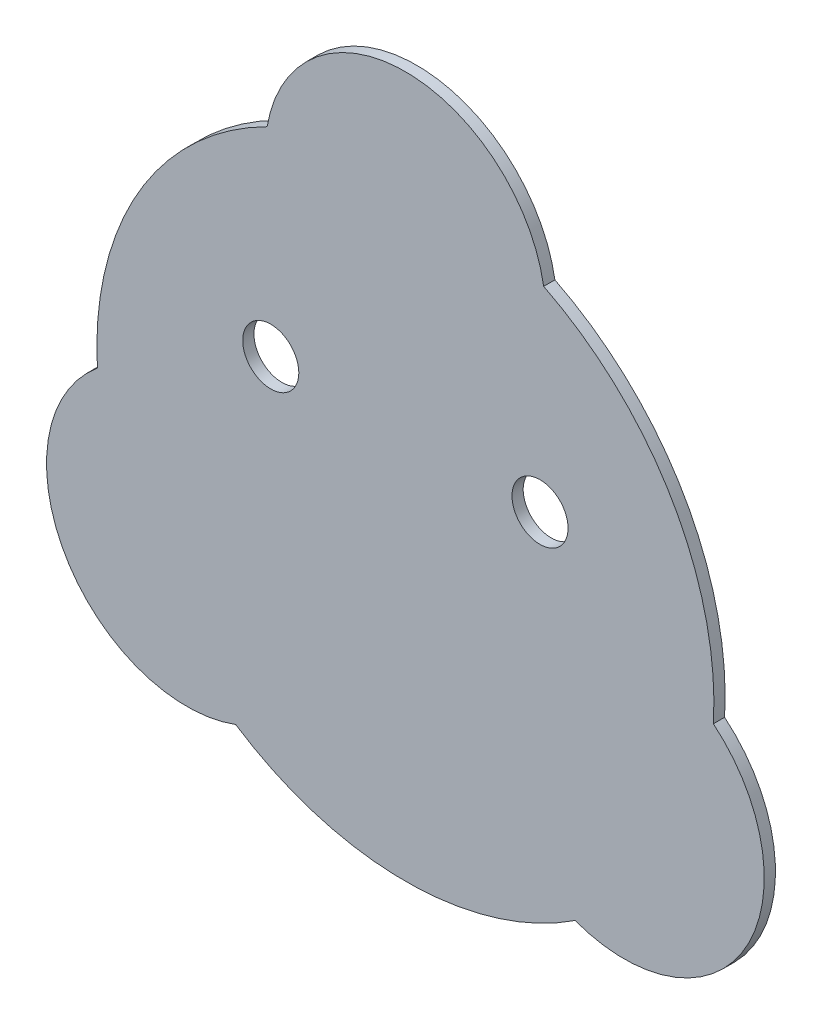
ISO-10303-21;
HEADER;
FILE_DESCRIPTION(('STEP AP214'),'2;1');
FILE_NAME('part.step','',(''),(''),'','','');
FILE_SCHEMA(('AUTOMOTIVE_DESIGN { 1 0 10303 214 1 1 1 1 }'));
ENDSEC;
DATA;
#1=APPLICATION_CONTEXT('core data for automotive mechanical design processes');
#2=APPLICATION_PROTOCOL_DEFINITION('international standard','automotive_design',2000,#1);
#3=PRODUCT_CONTEXT('',#1,'mechanical');
#4=PRODUCT('Part','Part','',(#3));
#5=PRODUCT_RELATED_PRODUCT_CATEGORY('part','',(#4));
#6=PRODUCT_DEFINITION_FORMATION('','',#4);
#7=PRODUCT_DEFINITION_CONTEXT('part definition',#1,'design');
#8=PRODUCT_DEFINITION('design','',#6,#7);
#9=PRODUCT_DEFINITION_SHAPE('','',#8);
#10=(LENGTH_UNIT() NAMED_UNIT(*) SI_UNIT(.MILLI.,.METRE.));
#11=(NAMED_UNIT(*) PLANE_ANGLE_UNIT() SI_UNIT($,.RADIAN.));
#12=(NAMED_UNIT(*) SI_UNIT($,.STERADIAN.) SOLID_ANGLE_UNIT());
#13=UNCERTAINTY_MEASURE_WITH_UNIT(LENGTH_MEASURE(1.E-05),#10,'distance_accuracy_value','');
#14=(GEOMETRIC_REPRESENTATION_CONTEXT(3) GLOBAL_UNCERTAINTY_ASSIGNED_CONTEXT((#13)) GLOBAL_UNIT_ASSIGNED_CONTEXT((#10,
#11,#12)) REPRESENTATION_CONTEXT('',''));
#15=CARTESIAN_POINT('',(0.,0.,0.));
#16=DIRECTION('',(0.,0.,1.));
#17=DIRECTION('',(1.,0.,0.));
#18=AXIS2_PLACEMENT_3D('',#15,#16,#17);
#19=CARTESIAN_POINT('',(-443.859368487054,1317.25514614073,-2000.));
#20=DIRECTION('',(0.,0.,1.));
#21=DIRECTION('',(1.,0.,0.));
#22=AXIS2_PLACEMENT_3D('',#19,#20,#21);
#23=PLANE('',#22);
#24=CARTESIAN_POINT('',(-422.11658269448,1329.88014614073,-2000.));
#25=DIRECTION('',(0.,0.,1.));
#26=DIRECTION('',(1.,0.,0.));
#27=AXIS2_PLACEMENT_3D('',#24,#25,#26);
#28=CIRCLE('',#27,2.49999999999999);
#29=CARTESIAN_POINT('',(-419.61658269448,1329.88014614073,-2000.));
#30=VERTEX_POINT('',#29);
#31=EDGE_CURVE('E126',#30,#30,#28,.T.);
#32=ORIENTED_EDGE('',*,*,#31,.F.);
#33=EDGE_LOOP('',(#32));
#34=FACE_BOUND('',#33,.T.);
#35=CARTESIAN_POINT('',(-453.602154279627,1311.63014614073,-2000.));
#36=DIRECTION('',(0.,0.,1.));
#37=DIRECTION('',(1.,0.,0.));
#38=AXIS2_PLACEMENT_3D('',#35,#36,#37);
#39=CIRCLE('',#38,12.5);
#40=CARTESIAN_POINT('',(-461.568956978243,1321.26238652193,-2000.));
#41=VERTEX_POINT('',#40);
#42=CARTESIAN_POINT('',(-449.24379076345,1299.91457242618,-2000.));
#43=VERTEX_POINT('',#42);
#44=EDGE_CURVE('E133',#41,#43,#39,.T.);
#45=ORIENTED_EDGE('',*,*,#44,.T.);
#46=CARTESIAN_POINT('',(-434.11658269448,1322.88014614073,-2000.));
#47=DIRECTION('',(0.,0.,1.));
#48=DIRECTION('',(1.,0.,0.));
#49=AXIS2_PLACEMENT_3D('',#46,#47,#48);
#50=CIRCLE('',#49,27.5);
#51=CARTESIAN_POINT('',(-418.989374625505,1299.91457242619,-2000.));
#52=VERTEX_POINT('',#51);
#53=EDGE_CURVE('E91',#43,#52,#50,.T.);
#54=ORIENTED_EDGE('',*,*,#53,.T.);
#55=CARTESIAN_POINT('',(-414.631011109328,1311.63014614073,-2000.));
#56=DIRECTION('',(0.,0.,1.));
#57=DIRECTION('',(1.,0.,0.));
#58=AXIS2_PLACEMENT_3D('',#55,#56,#57);
#59=CIRCLE('',#58,12.5);
#60=CARTESIAN_POINT('',(-406.664208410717,1321.26238652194,-2000.));
#61=VERTEX_POINT('',#60);
#62=EDGE_CURVE('E104',#52,#61,#59,.T.);
#63=ORIENTED_EDGE('',*,*,#62,.T.);
#64=CARTESIAN_POINT('',(-434.11658269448,1322.88014614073,-2000.));
#65=DIRECTION('',(0.,0.,1.));
#66=DIRECTION('',(1.,0.,0.));
#67=AXIS2_PLACEMENT_3D('',#64,#65,#66);
#68=CIRCLE('',#67,27.5);
#69=CARTESIAN_POINT('',(-421.791416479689,1347.46347947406,-2000.));
#70=VERTEX_POINT('',#69);
#71=EDGE_CURVE('E98',#61,#70,#68,.T.);
#72=ORIENTED_EDGE('',*,*,#71,.T.);
#73=CARTESIAN_POINT('',(-434.11658269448,1345.38014614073,-2000.));
#74=DIRECTION('',(0.,0.,1.));
#75=DIRECTION('',(1.,0.,0.));
#76=AXIS2_PLACEMENT_3D('',#73,#74,#75);
#77=CIRCLE('',#76,12.5000000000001);
#78=CARTESIAN_POINT('',(-446.441748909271,1347.46347947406,-2000.));
#79=VERTEX_POINT('',#78);
#80=EDGE_CURVE('E102',#70,#79,#77,.T.);
#81=ORIENTED_EDGE('',*,*,#80,.T.);
#82=CARTESIAN_POINT('',(-434.11658269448,1322.88014614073,-2000.));
#83=DIRECTION('',(0.,0.,1.));
#84=DIRECTION('',(1.,0.,0.));
#85=AXIS2_PLACEMENT_3D('',#82,#83,#84);
#86=CIRCLE('',#85,27.5000000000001);
#87=EDGE_CURVE('E54',#79,#41,#86,.T.);
#88=ORIENTED_EDGE('',*,*,#87,.T.);
#89=EDGE_LOOP('',(#45,#54,#63,#72,#81,#88));
#90=FACE_BOUND('',#89,.T.);
#91=CARTESIAN_POINT('',(-446.11658269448,1329.88014614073,-2000.));
#92=DIRECTION('',(0.,0.,1.));
#93=DIRECTION('',(1.,0.,0.));
#94=AXIS2_PLACEMENT_3D('',#91,#92,#93);
#95=CIRCLE('',#94,2.49999999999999);
#96=CARTESIAN_POINT('',(-443.61658269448,1329.88014614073,-2000.));
#97=VERTEX_POINT('',#96);
#98=EDGE_CURVE('E175',#97,#97,#95,.T.);
#99=ORIENTED_EDGE('',*,*,#98,.F.);
#100=EDGE_LOOP('',(#99));
#101=FACE_BOUND('',#100,.T.);
#102=ADVANCED_FACE('F37',(#34,#90,#101),#23,.T.);
#103=CARTESIAN_POINT('',(-443.859368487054,1317.25514614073,-2001.));
#104=DIRECTION('',(0.,0.,1.));
#105=DIRECTION('',(1.,0.,0.));
#106=AXIS2_PLACEMENT_3D('',#103,#104,#105);
#107=PLANE('',#106);
#108=CARTESIAN_POINT('',(-453.602154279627,1311.63014614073,-2001.));
#109=DIRECTION('',(0.,0.,1.));
#110=DIRECTION('',(1.,0.,0.));
#111=AXIS2_PLACEMENT_3D('',#108,#109,#110);
#112=CIRCLE('',#111,12.5);
#113=CARTESIAN_POINT('',(-461.568956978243,1321.26238652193,-2001.));
#114=VERTEX_POINT('',#113);
#115=CARTESIAN_POINT('',(-449.24379076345,1299.91457242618,-2001.));
#116=VERTEX_POINT('',#115);
#117=EDGE_CURVE('E122',#114,#116,#112,.T.);
#118=ORIENTED_EDGE('',*,*,#117,.F.);
#119=CARTESIAN_POINT('',(-434.11658269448,1322.88014614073,-2001.));
#120=DIRECTION('',(0.,0.,1.));
#121=DIRECTION('',(1.,0.,0.));
#122=AXIS2_PLACEMENT_3D('',#119,#120,#121);
#123=CIRCLE('',#122,27.5000000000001);
#124=CARTESIAN_POINT('',(-446.441748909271,1347.46347947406,-2001.));
#125=VERTEX_POINT('',#124);
#126=EDGE_CURVE('E83',#125,#114,#123,.T.);
#127=ORIENTED_EDGE('',*,*,#126,.F.);
#128=CARTESIAN_POINT('',(-434.11658269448,1345.38014614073,-2001.));
#129=DIRECTION('',(0.,0.,1.));
#130=DIRECTION('',(1.,0.,0.));
#131=AXIS2_PLACEMENT_3D('',#128,#129,#130);
#132=CIRCLE('',#131,12.5000000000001);
#133=CARTESIAN_POINT('',(-421.791416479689,1347.46347947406,-2001.));
#134=VERTEX_POINT('',#133);
#135=EDGE_CURVE('E77',#134,#125,#132,.T.);
#136=ORIENTED_EDGE('',*,*,#135,.F.);
#137=CARTESIAN_POINT('',(-434.11658269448,1322.88014614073,-2001.));
#138=DIRECTION('',(0.,0.,1.));
#139=DIRECTION('',(1.,0.,0.));
#140=AXIS2_PLACEMENT_3D('',#137,#138,#139);
#141=CIRCLE('',#140,27.5);
#142=CARTESIAN_POINT('',(-406.664208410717,1321.26238652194,-2001.));
#143=VERTEX_POINT('',#142);
#144=EDGE_CURVE('E112',#143,#134,#141,.T.);
#145=ORIENTED_EDGE('',*,*,#144,.F.);
#146=CARTESIAN_POINT('',(-414.631011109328,1311.63014614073,-2001.));
#147=DIRECTION('',(0.,0.,1.));
#148=DIRECTION('',(1.,0.,0.));
#149=AXIS2_PLACEMENT_3D('',#146,#147,#148);
#150=CIRCLE('',#149,12.5);
#151=CARTESIAN_POINT('',(-418.989374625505,1299.91457242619,-2001.));
#152=VERTEX_POINT('',#151);
#153=EDGE_CURVE('E128',#152,#143,#150,.T.);
#154=ORIENTED_EDGE('',*,*,#153,.F.);
#155=CARTESIAN_POINT('',(-434.11658269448,1322.88014614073,-2001.));
#156=DIRECTION('',(0.,0.,1.));
#157=DIRECTION('',(1.,0.,0.));
#158=AXIS2_PLACEMENT_3D('',#155,#156,#157);
#159=CIRCLE('',#158,27.5);
#160=EDGE_CURVE('E125',#116,#152,#159,.T.);
#161=ORIENTED_EDGE('',*,*,#160,.F.);
#162=EDGE_LOOP('',(#118,#127,#136,#145,#154,#161));
#163=FACE_BOUND('',#162,.T.);
#164=CARTESIAN_POINT('',(-422.11658269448,1329.88014614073,-2001.));
#165=DIRECTION('',(0.,0.,1.));
#166=DIRECTION('',(1.,0.,0.));
#167=AXIS2_PLACEMENT_3D('',#164,#165,#166);
#168=CIRCLE('',#167,2.49999999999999);
#169=CARTESIAN_POINT('',(-419.61658269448,1329.88014614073,-2001.));
#170=VERTEX_POINT('',#169);
#171=EDGE_CURVE('E181',#170,#170,#168,.T.);
#172=ORIENTED_EDGE('',*,*,#171,.T.);
#173=EDGE_LOOP('',(#172));
#174=FACE_BOUND('',#173,.T.);
#175=CARTESIAN_POINT('',(-446.11658269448,1329.88014614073,-2001.));
#176=DIRECTION('',(0.,0.,1.));
#177=DIRECTION('',(1.,0.,0.));
#178=AXIS2_PLACEMENT_3D('',#175,#176,#177);
#179=CIRCLE('',#178,2.49999999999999);
#180=CARTESIAN_POINT('',(-443.61658269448,1329.88014614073,-2001.));
#181=VERTEX_POINT('',#180);
#182=EDGE_CURVE('E178',#181,#181,#179,.T.);
#183=ORIENTED_EDGE('',*,*,#182,.T.);
#184=EDGE_LOOP('',(#183));
#185=FACE_BOUND('',#184,.T.);
#186=ADVANCED_FACE('F142',(#163,#174,#185),#107,.F.);
#187=CARTESIAN_POINT('',(-453.602154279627,1311.63014614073,-2000.));
#188=DIRECTION('',(0.,0.,-1.));
#189=DIRECTION('',(-1.,0.,0.));
#190=AXIS2_PLACEMENT_3D('',#187,#188,#189);
#191=CYLINDRICAL_SURFACE('',#190,12.5);
#192=ORIENTED_EDGE('',*,*,#117,.T.);
#193=DIRECTION('',(0.,0.,-1.));
#194=VECTOR('',#193,1.);
#195=CARTESIAN_POINT('',(-449.24379076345,1299.91457242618,-2000.));
#196=LINE('',#195,#194);
#197=EDGE_CURVE('E11',#43,#116,#196,.T.);
#198=ORIENTED_EDGE('',*,*,#197,.F.);
#199=ORIENTED_EDGE('',*,*,#44,.F.);
#200=DIRECTION('',(0.,0.,-1.));
#201=VECTOR('',#200,1.);
#202=CARTESIAN_POINT('',(-461.568956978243,1321.26238652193,-2000.));
#203=LINE('',#202,#201);
#204=EDGE_CURVE('E118',#41,#114,#203,.T.);
#205=ORIENTED_EDGE('',*,*,#204,.T.);
#206=EDGE_LOOP('',(#192,#198,#199,#205));
#207=FACE_BOUND('',#206,.T.);
#208=ADVANCED_FACE('F39',(#207),#191,.T.);
#209=CARTESIAN_POINT('',(-434.11658269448,1322.88014614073,-2000.));
#210=DIRECTION('',(0.,0.,-1.));
#211=DIRECTION('',(-1.,0.,0.));
#212=AXIS2_PLACEMENT_3D('',#209,#210,#211);
#213=CYLINDRICAL_SURFACE('',#212,27.5);
#214=ORIENTED_EDGE('',*,*,#160,.T.);
#215=DIRECTION('',(0.,0.,-1.));
#216=VECTOR('',#215,1.);
#217=CARTESIAN_POINT('',(-418.989374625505,1299.91457242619,-2000.));
#218=LINE('',#217,#216);
#219=EDGE_CURVE('E46',#52,#152,#218,.T.);
#220=ORIENTED_EDGE('',*,*,#219,.F.);
#221=ORIENTED_EDGE('',*,*,#53,.F.);
#222=ORIENTED_EDGE('',*,*,#197,.T.);
#223=EDGE_LOOP('',(#214,#220,#221,#222));
#224=FACE_BOUND('',#223,.T.);
#225=ADVANCED_FACE('F222',(#224),#213,.T.);
#226=CARTESIAN_POINT('',(-414.631011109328,1311.63014614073,-2000.));
#227=DIRECTION('',(0.,0.,-1.));
#228=DIRECTION('',(-1.,0.,0.));
#229=AXIS2_PLACEMENT_3D('',#226,#227,#228);
#230=CYLINDRICAL_SURFACE('',#229,12.5);
#231=ORIENTED_EDGE('',*,*,#153,.T.);
#232=DIRECTION('',(0.,0.,-1.));
#233=VECTOR('',#232,1.);
#234=CARTESIAN_POINT('',(-406.664208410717,1321.26238652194,-2000.));
#235=LINE('',#234,#233);
#236=EDGE_CURVE('E113',#61,#143,#235,.T.);
#237=ORIENTED_EDGE('',*,*,#236,.F.);
#238=ORIENTED_EDGE('',*,*,#62,.F.);
#239=ORIENTED_EDGE('',*,*,#219,.T.);
#240=EDGE_LOOP('',(#231,#237,#238,#239));
#241=FACE_BOUND('',#240,.T.);
#242=ADVANCED_FACE('F139',(#241),#230,.T.);
#243=CARTESIAN_POINT('',(-434.11658269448,1322.88014614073,-2000.));
#244=DIRECTION('',(0.,0.,-1.));
#245=DIRECTION('',(-1.,0.,0.));
#246=AXIS2_PLACEMENT_3D('',#243,#244,#245);
#247=CYLINDRICAL_SURFACE('',#246,27.5);
#248=ORIENTED_EDGE('',*,*,#144,.T.);
#249=DIRECTION('',(0.,0.,-1.));
#250=VECTOR('',#249,1.);
#251=CARTESIAN_POINT('',(-421.791416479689,1347.46347947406,-2000.));
#252=LINE('',#251,#250);
#253=EDGE_CURVE('E109',#70,#134,#252,.T.);
#254=ORIENTED_EDGE('',*,*,#253,.F.);
#255=ORIENTED_EDGE('',*,*,#71,.F.);
#256=ORIENTED_EDGE('',*,*,#236,.T.);
#257=EDGE_LOOP('',(#248,#254,#255,#256));
#258=FACE_BOUND('',#257,.T.);
#259=ADVANCED_FACE('F110',(#258),#247,.T.);
#260=CARTESIAN_POINT('',(-434.11658269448,1345.38014614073,-2000.));
#261=DIRECTION('',(0.,0.,-1.));
#262=DIRECTION('',(-1.,0.,0.));
#263=AXIS2_PLACEMENT_3D('',#260,#261,#262);
#264=CYLINDRICAL_SURFACE('',#263,12.5000000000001);
#265=ORIENTED_EDGE('',*,*,#135,.T.);
#266=DIRECTION('',(0.,0.,-1.));
#267=VECTOR('',#266,1.);
#268=CARTESIAN_POINT('',(-446.441748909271,1347.46347947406,-2000.));
#269=LINE('',#268,#267);
#270=EDGE_CURVE('E114',#79,#125,#269,.T.);
#271=ORIENTED_EDGE('',*,*,#270,.F.);
#272=ORIENTED_EDGE('',*,*,#80,.F.);
#273=ORIENTED_EDGE('',*,*,#253,.T.);
#274=EDGE_LOOP('',(#265,#271,#272,#273));
#275=FACE_BOUND('',#274,.T.);
#276=ADVANCED_FACE('F116',(#275),#264,.T.);
#277=CARTESIAN_POINT('',(-434.11658269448,1322.88014614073,-2000.));
#278=DIRECTION('',(0.,0.,-1.));
#279=DIRECTION('',(-1.,0.,0.));
#280=AXIS2_PLACEMENT_3D('',#277,#278,#279);
#281=CYLINDRICAL_SURFACE('',#280,27.5000000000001);
#282=ORIENTED_EDGE('',*,*,#126,.T.);
#283=ORIENTED_EDGE('',*,*,#204,.F.);
#284=ORIENTED_EDGE('',*,*,#87,.F.);
#285=ORIENTED_EDGE('',*,*,#270,.T.);
#286=EDGE_LOOP('',(#282,#283,#284,#285));
#287=FACE_BOUND('',#286,.T.);
#288=ADVANCED_FACE('F147',(#287),#281,.T.);
#289=CARTESIAN_POINT('',(-422.11658269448,1329.88014614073,-2000.));
#290=DIRECTION('',(0.,0.,-1.));
#291=DIRECTION('',(-1.,0.,0.));
#292=AXIS2_PLACEMENT_3D('',#289,#290,#291);
#293=CYLINDRICAL_SURFACE('',#292,2.49999999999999);
#294=ORIENTED_EDGE('',*,*,#31,.T.);
#295=EDGE_LOOP('',(#294));
#296=FACE_BOUND('',#295,.T.);
#297=ORIENTED_EDGE('',*,*,#171,.F.);
#298=EDGE_LOOP('',(#297));
#299=FACE_BOUND('',#298,.T.);
#300=ADVANCED_FACE('F149',(#296,#299),#293,.F.);
#301=CARTESIAN_POINT('',(-446.11658269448,1329.88014614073,-2000.));
#302=DIRECTION('',(0.,0.,-1.));
#303=DIRECTION('',(-1.,0.,0.));
#304=AXIS2_PLACEMENT_3D('',#301,#302,#303);
#305=CYLINDRICAL_SURFACE('',#304,2.49999999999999);
#306=ORIENTED_EDGE('',*,*,#98,.T.);
#307=EDGE_LOOP('',(#306));
#308=FACE_BOUND('',#307,.T.);
#309=ORIENTED_EDGE('',*,*,#182,.F.);
#310=EDGE_LOOP('',(#309));
#311=FACE_BOUND('',#310,.T.);
#312=ADVANCED_FACE('F155',(#308,#311),#305,.F.);
#313=CLOSED_SHELL('',(#102,#186,#208,#225,#242,#259,#276,#288,#300,#312));
#314=MANIFOLD_SOLID_BREP('B2',#313);
#315=ADVANCED_BREP_SHAPE_REPRESENTATION('',(#18,#314),#14);
#316=SHAPE_DEFINITION_REPRESENTATION(#9,#315);
ENDSEC;
END-ISO-10303-21;
